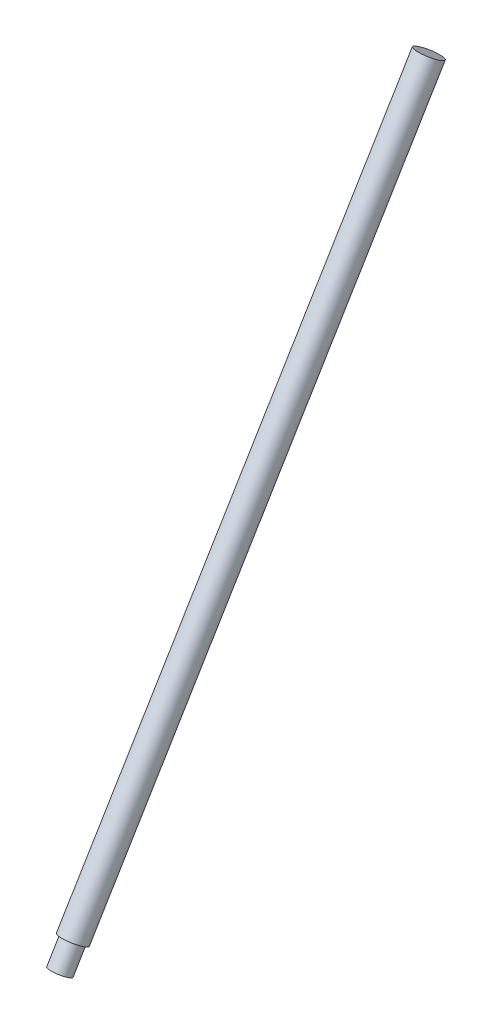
ISO-10303-21;
HEADER;
FILE_DESCRIPTION(('STEP AP214'),'2;1');
FILE_NAME('part.step','',(''),(''),'','','');
FILE_SCHEMA(('AUTOMOTIVE_DESIGN { 1 0 10303 214 1 1 1 1 }'));
ENDSEC;
DATA;
#1=APPLICATION_CONTEXT('core data for automotive mechanical design processes');
#2=APPLICATION_PROTOCOL_DEFINITION('international standard','automotive_design',2000,#1);
#3=PRODUCT_CONTEXT('',#1,'mechanical');
#4=PRODUCT('Part','Part','',(#3));
#5=PRODUCT_RELATED_PRODUCT_CATEGORY('part','',(#4));
#6=PRODUCT_DEFINITION_FORMATION('','',#4);
#7=PRODUCT_DEFINITION_CONTEXT('part definition',#1,'design');
#8=PRODUCT_DEFINITION('design','',#6,#7);
#9=PRODUCT_DEFINITION_SHAPE('','',#8);
#10=(LENGTH_UNIT() NAMED_UNIT(*) SI_UNIT(.MILLI.,.METRE.));
#11=(NAMED_UNIT(*) PLANE_ANGLE_UNIT() SI_UNIT($,.RADIAN.));
#12=(NAMED_UNIT(*) SI_UNIT($,.STERADIAN.) SOLID_ANGLE_UNIT());
#13=UNCERTAINTY_MEASURE_WITH_UNIT(LENGTH_MEASURE(1.E-05),#10,'distance_accuracy_value','');
#14=(GEOMETRIC_REPRESENTATION_CONTEXT(3) GLOBAL_UNCERTAINTY_ASSIGNED_CONTEXT((#13)) GLOBAL_UNIT_ASSIGNED_CONTEXT((#10,
#11,#12)) REPRESENTATION_CONTEXT('',''));
#15=CARTESIAN_POINT('',(0.,0.,0.));
#16=DIRECTION('',(0.,0.,1.));
#17=DIRECTION('',(1.,0.,0.));
#18=AXIS2_PLACEMENT_3D('',#15,#16,#17);
#19=CARTESIAN_POINT('',(0.,-1551.164396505,2073.096747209));
#20=DIRECTION('',(0.,-0.856064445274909,0.516869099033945));
#21=DIRECTION('',(-1.,0.,0.));
#22=AXIS2_PLACEMENT_3D('',#19,#20,#21);
#23=PLANE('',#22);
#24=CARTESIAN_POINT('',(0.,-1551.164396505,2073.096747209));
#25=DIRECTION('',(0.,-0.856064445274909,0.516869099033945));
#26=DIRECTION('',(0.,-0.516869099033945,-0.856064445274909));
#27=AXIS2_PLACEMENT_3D('',#24,#25,#26);
#28=CIRCLE('',#27,10.);
#29=CARTESIAN_POINT('',(0.,-1556.33308749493,2064.53610275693));
#30=VERTEX_POINT('',#29);
#31=EDGE_CURVE('E9',#30,#30,#28,.T.);
#32=ORIENTED_EDGE('',*,*,#31,.T.);
#33=EDGE_LOOP('',(#32));
#34=FACE_BOUND('',#33,.T.);
#35=ADVANCED_FACE('F14',(#34),#23,.T.);
#36=CARTESIAN_POINT('',(0.,-1529.762785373,2060.175019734));
#37=DIRECTION('',(0.,-0.856064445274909,0.516869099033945));
#38=DIRECTION('',(0.,-0.516869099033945,-0.856064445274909));
#39=AXIS2_PLACEMENT_3D('',#36,#37,#38);
#40=CYLINDRICAL_SURFACE('',#39,10.);
#41=CARTESIAN_POINT('',(0.,-1529.762785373,2060.175019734));
#42=DIRECTION('',(0.,-0.856064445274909,0.516869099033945));
#43=DIRECTION('',(0.,-0.516869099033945,-0.856064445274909));
#44=AXIS2_PLACEMENT_3D('',#41,#42,#43);
#45=CIRCLE('',#44,10.);
#46=CARTESIAN_POINT('',(0.,-1534.93147636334,2051.61437528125));
#47=VERTEX_POINT('',#46);
#48=EDGE_CURVE('E18',#47,#47,#45,.T.);
#49=CARTESIAN_POINT('',(0.,-1556.33308749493,2064.53610275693));
#50=CARTESIAN_POINT('',(0.,-1556.11015404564,2064.40150142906));
#51=CARTESIAN_POINT('',(0.,-1555.88722059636,2064.26690010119));
#52=CARTESIAN_POINT('',(0.,-1555.44135369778,2063.99769744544));
#53=CARTESIAN_POINT('',(0.,-1555.21842024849,2063.86309611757));
#54=CARTESIAN_POINT('',(0.,-1554.77255334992,2063.59389346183));
#55=CARTESIAN_POINT('',(0.,-1554.54961990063,2063.45929213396));
#56=CARTESIAN_POINT('',(0.,-1554.10375300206,2063.19008947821));
#57=CARTESIAN_POINT('',(0.,-1553.88081955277,2063.05548815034));
#58=CARTESIAN_POINT('',(0.,-1553.43495265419,2062.7862854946));
#59=CARTESIAN_POINT('',(0.,-1553.21201920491,2062.65168416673));
#60=CARTESIAN_POINT('',(0.,-1552.76615230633,2062.38248151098));
#61=CARTESIAN_POINT('',(0.,-1552.54321885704,2062.24788018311));
#62=CARTESIAN_POINT('',(0.,-1552.09735195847,2061.97867752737));
#63=CARTESIAN_POINT('',(0.,-1551.87441850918,2061.8440761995));
#64=CARTESIAN_POINT('',(0.,-1551.42855161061,2061.57487354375));
#65=CARTESIAN_POINT('',(0.,-1551.20561816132,2061.44027221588));
#66=CARTESIAN_POINT('',(0.,-1550.75975126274,2061.17106956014));
#67=CARTESIAN_POINT('',(0.,-1550.53681781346,2061.03646823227));
#68=CARTESIAN_POINT('',(0.,-1550.09095091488,2060.76726557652));
#69=CARTESIAN_POINT('',(0.,-1549.8680174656,2060.63266424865));
#70=CARTESIAN_POINT('',(0.,-1549.42215056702,2060.36346159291));
#71=CARTESIAN_POINT('',(0.,-1549.19921711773,2060.22886026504));
#72=CARTESIAN_POINT('',(0.,-1548.75335021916,2059.95965760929));
#73=CARTESIAN_POINT('',(0.,-1548.53041676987,2059.82505628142));
#74=CARTESIAN_POINT('',(0.,-1548.0845498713,2059.55585362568));
#75=CARTESIAN_POINT('',(0.,-1547.86161642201,2059.42125229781));
#76=CARTESIAN_POINT('',(0.,-1547.41574952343,2059.15204964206));
#77=CARTESIAN_POINT('',(0.,-1547.19281607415,2059.01744831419));
#78=CARTESIAN_POINT('',(0.,-1546.74694917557,2058.74824565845));
#79=CARTESIAN_POINT('',(0.,-1546.52401572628,2058.61364433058));
#80=CARTESIAN_POINT('',(0.,-1546.07814882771,2058.34444167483));
#81=CARTESIAN_POINT('',(0.,-1545.85521537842,2058.20984034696));
#82=CARTESIAN_POINT('',(0.,-1545.40934847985,2057.94063769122));
#83=CARTESIAN_POINT('',(0.,-1545.18641503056,2057.80603636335));
#84=CARTESIAN_POINT('',(0.,-1544.74054813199,2057.5368337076));
#85=CARTESIAN_POINT('',(0.,-1544.5176146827,2057.40223237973));
#86=CARTESIAN_POINT('',(0.,-1544.07174778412,2057.13302972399));
#87=CARTESIAN_POINT('',(0.,-1543.84881433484,2056.99842839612));
#88=CARTESIAN_POINT('',(0.,-1543.40294743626,2056.72922574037));
#89=CARTESIAN_POINT('',(0.,-1543.18001398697,2056.5946244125));
#90=CARTESIAN_POINT('',(0.,-1542.7341470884,2056.32542175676));
#91=CARTESIAN_POINT('',(0.,-1542.51121363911,2056.19082042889));
#92=CARTESIAN_POINT('',(0.,-1542.06534674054,2055.92161777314));
#93=CARTESIAN_POINT('',(0.,-1541.84241329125,2055.78701644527));
#94=CARTESIAN_POINT('',(0.,-1541.39654639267,2055.51781378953));
#95=CARTESIAN_POINT('',(0.,-1541.17361294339,2055.38321246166));
#96=CARTESIAN_POINT('',(0.,-1540.72774604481,2055.11400980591));
#97=CARTESIAN_POINT('',(0.,-1540.50481259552,2054.97940847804));
#98=CARTESIAN_POINT('',(0.,-1540.05894569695,2054.7102058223));
#99=CARTESIAN_POINT('',(0.,-1539.83601224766,2054.57560449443));
#100=CARTESIAN_POINT('',(0.,-1539.39014534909,2054.30640183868));
#101=CARTESIAN_POINT('',(0.,-1539.1672118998,2054.17180051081));
#102=CARTESIAN_POINT('',(0.,-1538.72134500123,2053.90259785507));
#103=CARTESIAN_POINT('',(0.,-1538.49841155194,2053.7679965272));
#104=CARTESIAN_POINT('',(0.,-1538.05254465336,2053.49879387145));
#105=CARTESIAN_POINT('',(0.,-1537.82961120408,2053.36419254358));
#106=CARTESIAN_POINT('',(0.,-1537.3837443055,2053.09498988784));
#107=CARTESIAN_POINT('',(0.,-1537.16081085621,2052.96038855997));
#108=CARTESIAN_POINT('',(0.,-1536.71494395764,2052.69118590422));
#109=CARTESIAN_POINT('',(0.,-1536.49201050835,2052.55658457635));
#110=CARTESIAN_POINT('',(0.,-1536.04614360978,2052.28738192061));
#111=CARTESIAN_POINT('',(0.,-1535.82321016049,2052.15278059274));
#112=CARTESIAN_POINT('',(0.,-1535.37734326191,2051.88357793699));
#113=CARTESIAN_POINT('',(0.,-1535.15440981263,2051.74897660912));
#114=CARTESIAN_POINT('',(0.,-1534.93147636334,2051.61437528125));
#115=B_SPLINE_CURVE_WITH_KNOTS('',3,(#49,#50,#51,#52,#53,#54,#55,#56,#57,#58,#59,#60,#61,#62,
#63,#64,#65,#66,#67,#68,#69,#70,#71,#72,#73,#74,#75,#76,#77,#78,#79,#80,#81,#82,#83,#84,#85,#86,
#87,#88,#89,#90,#91,#92,#93,#94,#95,#96,#97,#98,#99,#100,#101,#102,#103,#104,#105,#106,#107,
#108,#109,#110,#111,#112,#113,#114),.UNSPECIFIED.,.F.,.F.,(4,2,2,2,2,2,2,2,2,2,2,2,2,2,2,2,2,2,
2,2,2,2,2,2,2,2,2,2,2,2,2,2,4),(0.,0.781249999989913,1.56249999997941,2.34374999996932,
3.12499999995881,3.90624999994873,4.68749999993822,5.46874999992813,6.24999999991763,
7.03124999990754,7.81249999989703,8.59374999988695,9.37499999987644,10.1562499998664,
10.9374999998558,11.7187499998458,12.4999999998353,13.281249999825,14.0624999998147,
14.8437499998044,15.6249999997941,16.4062499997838,17.1874999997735,17.9687499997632,
18.7499999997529,19.5312499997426,20.3124999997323,21.093749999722,21.8749999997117,
22.6562499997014,23.4374999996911,24.2187499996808,24.9999999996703),.UNSPECIFIED.);
#116=EDGE_CURVE('BSEAM47',#30,#47,#115,.T.);
#117=ORIENTED_EDGE('',*,*,#31,.F.);
#118=ORIENTED_EDGE('',*,*,#48,.T.);
#119=ORIENTED_EDGE('',*,*,#116,.T.);
#120=ORIENTED_EDGE('',*,*,#116,.F.);
#121=EDGE_LOOP('',(#117,#119,#118,#120));
#122=FACE_BOUND('',#121,.T.);
#123=ADVANCED_FACE('F47',(#122),#40,.T.);
#124=CARTESIAN_POINT('',(0.,-943.3586403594,1706.119686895));
#125=DIRECTION('',(0.,-0.856064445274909,0.516869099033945));
#126=DIRECTION('',(-1.,0.,0.));
#127=AXIS2_PLACEMENT_3D('',#124,#125,#126);
#128=PLANE('',#127);
#129=CARTESIAN_POINT('',(0.,-943.3586403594,1706.119686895));
#130=DIRECTION('',(0.,-0.856064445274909,0.516869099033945));
#131=DIRECTION('',(0.,-0.516869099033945,-0.856064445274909));
#132=AXIS2_PLACEMENT_3D('',#129,#130,#131);
#133=CIRCLE('',#132,12.5);
#134=CARTESIAN_POINT('',(0.,-949.819504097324,1695.41888132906));
#135=VERTEX_POINT('',#134);
#136=EDGE_CURVE('E28',#135,#135,#133,.T.);
#137=ORIENTED_EDGE('',*,*,#136,.F.);
#138=EDGE_LOOP('',(#137));
#139=FACE_BOUND('',#138,.T.);
#140=ADVANCED_FACE('F16',(#139),#128,.F.);
#141=CARTESIAN_POINT('',(0.,-1529.762785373,2060.175019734));
#142=DIRECTION('',(0.,-0.856064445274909,0.516869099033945));
#143=DIRECTION('',(-1.,0.,0.));
#144=AXIS2_PLACEMENT_3D('',#141,#142,#143);
#145=PLANE('',#144);
#146=ORIENTED_EDGE('',*,*,#48,.F.);
#147=EDGE_LOOP('',(#146));
#148=FACE_BOUND('',#147,.T.);
#149=CARTESIAN_POINT('',(0.,-1529.762785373,2060.175019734));
#150=DIRECTION('',(0.,-0.856064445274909,0.516869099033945));
#151=DIRECTION('',(0.,-0.516869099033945,-0.856064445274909));
#152=AXIS2_PLACEMENT_3D('',#149,#150,#151);
#153=CIRCLE('',#152,12.5);
#154=CARTESIAN_POINT('',(0.,-1536.22364911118,2049.47421416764));
#155=VERTEX_POINT('',#154);
#156=EDGE_CURVE('E35',#155,#155,#153,.T.);
#157=ORIENTED_EDGE('',*,*,#156,.T.);
#158=EDGE_LOOP('',(#157));
#159=FACE_BOUND('',#158,.T.);
#160=ADVANCED_FACE('F37',(#148,#159),#145,.T.);
#161=CARTESIAN_POINT('',(0.,-943.3586403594,1706.119686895));
#162=DIRECTION('',(0.,-0.856064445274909,0.516869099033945));
#163=DIRECTION('',(0.,-0.516869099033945,-0.856064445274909));
#164=AXIS2_PLACEMENT_3D('',#161,#162,#163);
#165=CYLINDRICAL_SURFACE('',#164,12.5);
#166=CARTESIAN_POINT('',(0.,-1536.22364911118,2049.47421416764));
#167=CARTESIAN_POINT('',(0.,-1530.11527260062,2045.78613778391));
#168=CARTESIAN_POINT('',(0.,-1524.00689609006,2042.09806140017));
#169=CARTESIAN_POINT('',(0.,-1511.79014306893,2034.7219086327));
#170=CARTESIAN_POINT('',(0.,-1505.68176655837,2031.03383224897));
#171=CARTESIAN_POINT('',(0.,-1493.46501353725,2023.6576794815));
#172=CARTESIAN_POINT('',(0.,-1487.35663702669,2019.96960309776));
#173=CARTESIAN_POINT('',(0.,-1475.13988400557,2012.59345033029));
#174=CARTESIAN_POINT('',(0.,-1469.03150749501,2008.90537394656));
#175=CARTESIAN_POINT('',(0.,-1456.81475447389,2001.52922117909));
#176=CARTESIAN_POINT('',(0.,-1450.70637796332,1997.84114479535));
#177=CARTESIAN_POINT('',(0.,-1438.4896249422,1990.46499202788));
#178=CARTESIAN_POINT('',(0.,-1432.38124843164,1986.77691564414));
#179=CARTESIAN_POINT('',(0.,-1420.16449541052,1979.40076287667));
#180=CARTESIAN_POINT('',(0.,-1414.05611889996,1975.71268649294));
#181=CARTESIAN_POINT('',(0.,-1401.83936587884,1968.33653372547));
#182=CARTESIAN_POINT('',(0.,-1395.73098936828,1964.64845734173));
#183=CARTESIAN_POINT('',(0.,-1383.51423634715,1957.27230457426));
#184=CARTESIAN_POINT('',(0.,-1377.40585983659,1953.58422819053));
#185=CARTESIAN_POINT('',(0.,-1365.18910681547,1946.20807542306));
#186=CARTESIAN_POINT('',(0.,-1359.08073030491,1942.51999903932));
#187=CARTESIAN_POINT('',(0.,-1346.86397728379,1935.14384627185));
#188=CARTESIAN_POINT('',(0.,-1340.75560077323,1931.45576988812));
#189=CARTESIAN_POINT('',(0.,-1328.5388477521,1924.07961712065));
#190=CARTESIAN_POINT('',(0.,-1322.43047124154,1920.39154073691));
#191=CARTESIAN_POINT('',(0.,-1310.21371822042,1913.01538796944));
#192=CARTESIAN_POINT('',(0.,-1304.10534170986,1909.32731158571));
#193=CARTESIAN_POINT('',(0.,-1291.88858868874,1901.95115881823));
#194=CARTESIAN_POINT('',(0.,-1285.78021217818,1898.2630824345));
#195=CARTESIAN_POINT('',(0.,-1273.56345915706,1890.88692966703));
#196=CARTESIAN_POINT('',(0.,-1267.4550826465,1887.19885328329));
#197=CARTESIAN_POINT('',(0.,-1255.23832962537,1879.82270051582));
#198=CARTESIAN_POINT('',(0.,-1249.12995311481,1876.13462413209));
#199=CARTESIAN_POINT('',(0.,-1236.91320009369,1868.75847136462));
#200=CARTESIAN_POINT('',(0.,-1230.80482358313,1865.07039498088));
#201=CARTESIAN_POINT('',(0.,-1218.58807056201,1857.69424221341));
#202=CARTESIAN_POINT('',(0.,-1212.47969405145,1854.00616582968));
#203=CARTESIAN_POINT('',(0.,-1200.26294103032,1846.63001306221));
#204=CARTESIAN_POINT('',(0.,-1194.15456451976,1842.94193667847));
#205=CARTESIAN_POINT('',(0.,-1181.93781149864,1835.565783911));
#206=CARTESIAN_POINT('',(0.,-1175.82943498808,1831.87770752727));
#207=CARTESIAN_POINT('',(0.,-1163.61268196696,1824.5015547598));
#208=CARTESIAN_POINT('',(0.,-1157.5043054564,1820.81347837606));
#209=CARTESIAN_POINT('',(0.,-1145.28755243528,1813.43732560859));
#210=CARTESIAN_POINT('',(0.,-1139.17917592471,1809.74924922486));
#211=CARTESIAN_POINT('',(0.,-1126.96242290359,1802.37309645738));
#212=CARTESIAN_POINT('',(0.,-1120.85404639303,1798.68502007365));
#213=CARTESIAN_POINT('',(0.,-1108.63729337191,1791.30886730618));
#214=CARTESIAN_POINT('',(0.,-1102.52891686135,1787.62079092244));
#215=CARTESIAN_POINT('',(0.,-1090.31216384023,1780.24463815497));
#216=CARTESIAN_POINT('',(0.,-1084.20378732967,1776.55656177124));
#217=CARTESIAN_POINT('',(0.,-1071.98703430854,1769.18040900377));
#218=CARTESIAN_POINT('',(0.,-1065.87865779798,1765.49233262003));
#219=CARTESIAN_POINT('',(0.,-1053.66190477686,1758.11617985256));
#220=CARTESIAN_POINT('',(0.,-1047.5535282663,1754.42810346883));
#221=CARTESIAN_POINT('',(0.,-1035.33677524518,1747.05195070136));
#222=CARTESIAN_POINT('',(0.,-1029.22839873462,1743.36387431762));
#223=CARTESIAN_POINT('',(0.,-1017.01164571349,1735.98772155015));
#224=CARTESIAN_POINT('',(0.,-1010.90326920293,1732.29964516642));
#225=CARTESIAN_POINT('',(0.,-998.686516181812,1724.92349239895));
#226=CARTESIAN_POINT('',(0.,-992.578139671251,1721.23541601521));
#227=CARTESIAN_POINT('',(0.,-980.361386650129,1713.85926324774));
#228=CARTESIAN_POINT('',(0.,-974.253010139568,1710.171186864));
#229=CARTESIAN_POINT('',(0.,-962.036257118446,1702.79503409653));
#230=CARTESIAN_POINT('',(0.,-955.927880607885,1699.1069577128));
#231=CARTESIAN_POINT('',(0.,-949.819504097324,1695.41888132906));
#232=B_SPLINE_CURVE_WITH_KNOTS('',3,(#166,#167,#168,#169,#170,#171,#172,#173,#174,#175,#176,
#177,#178,#179,#180,#181,#182,#183,#184,#185,#186,#187,#188,#189,#190,#191,#192,#193,#194,#195,
#196,#197,#198,#199,#200,#201,#202,#203,#204,#205,#206,#207,#208,#209,#210,#211,#212,#213,#214,
#215,#216,#217,#218,#219,#220,#221,#222,#223,#224,#225,#226,#227,#228,#229,#230,#231),
.UNSPECIFIED.,.F.,.F.,(4,2,2,2,2,2,2,2,2,2,2,2,2,2,2,2,2,2,2,2,2,2,2,2,2,2,2,2,2,2,2,2,4),(0.,
21.4062500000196,42.8125000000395,64.2187500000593,85.6250000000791,107.031250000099,
128.437500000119,149.843750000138,171.250000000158,192.656250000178,214.062500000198,
235.468750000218,256.875000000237,278.281250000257,299.687500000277,321.093750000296,
342.500000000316,363.906250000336,385.312500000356,406.718750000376,428.125000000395,
449.531250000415,470.937500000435,492.343750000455,513.750000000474,535.156250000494,
556.562500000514,577.968750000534,599.375000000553,620.781250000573,642.187500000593,
663.593750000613,685.000000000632),.UNSPECIFIED.);
#233=EDGE_CURVE('BSEAM45',#155,#135,#232,.T.);
#234=ORIENTED_EDGE('',*,*,#156,.F.);
#235=ORIENTED_EDGE('',*,*,#136,.T.);
#236=ORIENTED_EDGE('',*,*,#233,.T.);
#237=ORIENTED_EDGE('',*,*,#233,.F.);
#238=EDGE_LOOP('',(#234,#236,#235,#237));
#239=FACE_BOUND('',#238,.T.);
#240=ADVANCED_FACE('F45',(#239),#165,.T.);
#241=CLOSED_SHELL('',(#35,#123,#140,#160,#240));
#242=MANIFOLD_SOLID_BREP('B1',#241);
#243=ADVANCED_BREP_SHAPE_REPRESENTATION('',(#18,#242),#14);
#244=SHAPE_DEFINITION_REPRESENTATION(#9,#243);
ENDSEC;
END-ISO-10303-21;
